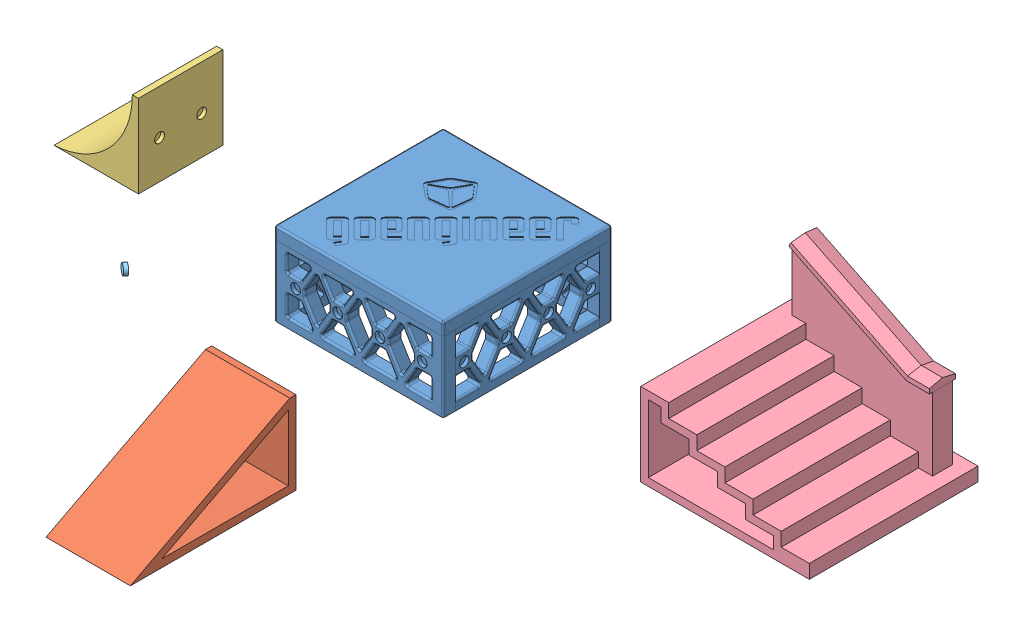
SolidWorks assembly Skate park - start.SLDASM, configuration Default (file format 14000). Lengths in mm.
Overall size (576.75 177.22 373.34).
5 component instances, 5 part files, 0 mates.
Components (placement in the parent):
- Main base-1: Main base.SLDPRT [Default] at origin size (139.7 68.58 139.7)
- Ramp-1: Ramp.SLDPRT [Default] at (-30.3649 -124.6247 126.4913) x (0 0 1) z (-1 0 0) size (137.16 68.58 69.85)
- Ramp2-1: Ramp2.SLDPRT [Default] at (-173.6671 -25.1747 43.7834) x (-1 0 0) z (0 0 -1) size (69.88 68.58 69.85)
- Steps-1: Steps.SLDPRT [Default] at (193.5043 -72.4822 -39.8401) size (139.7 125.08 139.7)
- Magnet-start-1: Magnet-start.SLDPRT [Default] at (-151.1883 -51.8169 110.272) x (0.783549 0.319394 0.532952) z (0.247672 -0.947223 0.203536) size (8.13 3.05 8.13)
